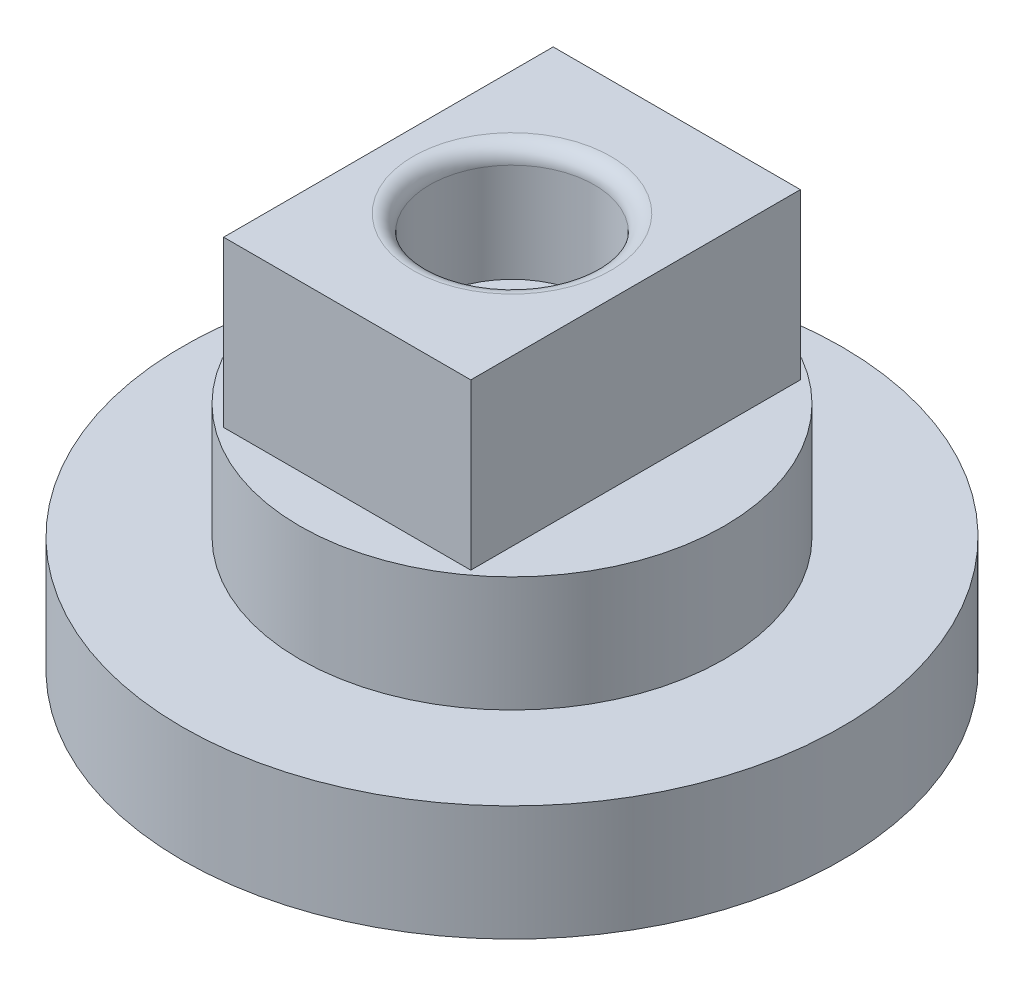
from build123d import *

# Parameters (mm, degrees)
SKIZZE1_R                       = 20
AUFSATZ_LINEAR_AUSTRAGEN1_DEPTH = 7
SKIZZE3_R                       = 12.875
AUFSATZ_LINEAR_AUSTRAGEN2_DEPTH = 7
SKIZZE7_W                       = 15
SKIZZE7_H                       = 20
AUFSATZ_LINEAR_AUSTRAGEN3_DEPTH = 10
SKIZZE8_R                       = 5
SCHNITT_LINEAR_AUSTRAGEN2_DEPTH = 7
VERRUNDUNG2_R                   = 1
SCHNITT_LINEAR_START            = -3
SKIZZE9_R                       = 5
SCHNITT_LINEAR_AUSTRAGEN3_DEPTH = 3
SKIZZE5_R                       = 3.5
SCHNITT_LINEAR_AUSTRAGEN4_DEPTH = 5


with BuildPart() as part:
    # Skizze1 → Aufsatz-Linear austragen1 (new body)
    with BuildSketch(Plane(origin=(0, 0, 0), x_dir=(1, 0, 0), z_dir=(0, 1, 0))):
        with Locations(Location((0, 0, 0), (0, 0, 270))):
            Circle(SKIZZE1_R)
    extrude(amount=AUFSATZ_LINEAR_AUSTRAGEN1_DEPTH)

    # Skizze3 → Aufsatz-Linear austragen2 (add)
    with BuildSketch(Plane(origin=(0, 7, 0), x_dir=(1, 0, 0), z_dir=(0, 1, 0))):
        with Locations(Location((0, 0, 0), (0, 0, 270))):
            Circle(SKIZZE3_R)
    extrude(amount=AUFSATZ_LINEAR_AUSTRAGEN2_DEPTH)

    # Skizze7 → Aufsatz-Linear austragen3 (add)
    with BuildSketch(Plane(origin=(0, 14, 0), x_dir=(1, 0, 0), z_dir=(0, 1, 0))):
        Rectangle(SKIZZE7_W, SKIZZE7_H)
    extrude(amount=AUFSATZ_LINEAR_AUSTRAGEN3_DEPTH)

    # Skizze8 → Schnitt-Linear austragen2 (cut)
    with BuildSketch(Plane(origin=(0, 24, 0), x_dir=(1, 0, 0), z_dir=(0, 1, 0))):
        with Locations(Location((0, 0, 0), (0, 0, 270))):
            Circle(SKIZZE8_R)
    extrude(amount=-SCHNITT_LINEAR_AUSTRAGEN2_DEPTH, mode=Mode.SUBTRACT)

    # Verrundung2
    verrundung2_edges = [part.edges().sort_by_distance(p)[0] for p in [
        (0, 24, -5),
    ]]
    fillet(verrundung2_edges, radius=VERRUNDUNG2_R)

    # Skizze9 → Schnitt-Linear austragen3 (cut)
    with BuildSketch(Plane.XZ.offset(SCHNITT_LINEAR_START)):
        with Locations(Location((0, 0, 0), (0, 0, 90))):
            Circle(SKIZZE9_R)
    extrude(amount=SCHNITT_LINEAR_AUSTRAGEN3_DEPTH, mode=Mode.SUBTRACT)

    # Skizze5 → Schnitt-Linear austragen4 (cut)
    with BuildSketch(Plane(origin=(0, 0, 0), x_dir=(-1, 0, 0), z_dir=(0, -1, 0))):
        with Locations(Location((0, -15, 0), (0, 0, 90))):
            Circle(SKIZZE5_R)
        with Locations(Location((-12.990381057, 7.5, 0), (0, 0, 90))):
            Circle(SKIZZE5_R)
        with Locations(Location((12.990381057, 7.5, 0), (0, 0, 90))):
            Circle(SKIZZE5_R)
    extrude(amount=-SCHNITT_LINEAR_AUSTRAGEN4_DEPTH, mode=Mode.SUBTRACT)


solid = part.part
